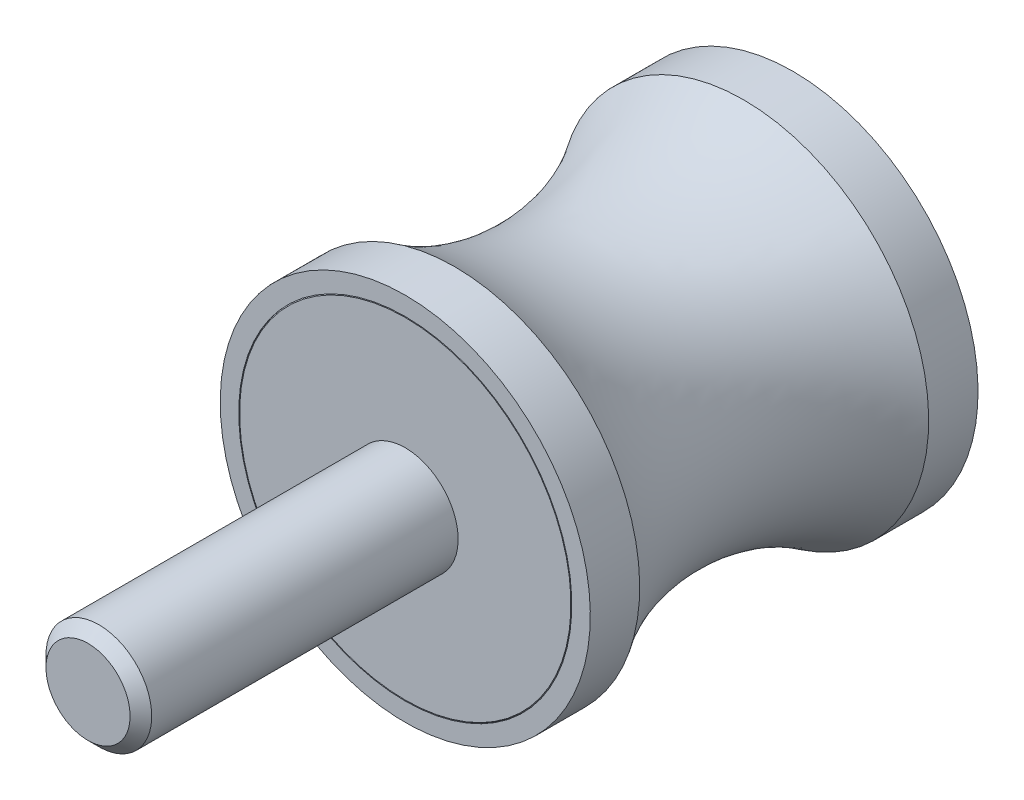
ISO-10303-21;
HEADER;
FILE_DESCRIPTION(('STEP AP214'),'2;1');
FILE_NAME('part.step','',(''),(''),'','','');
FILE_SCHEMA(('AUTOMOTIVE_DESIGN { 1 0 10303 214 1 1 1 1 }'));
ENDSEC;
DATA;
#1=APPLICATION_CONTEXT('core data for automotive mechanical design processes');
#2=APPLICATION_PROTOCOL_DEFINITION('international standard','automotive_design',2000,#1);
#3=PRODUCT_CONTEXT('',#1,'mechanical');
#4=PRODUCT('Part','Part','',(#3));
#5=PRODUCT_RELATED_PRODUCT_CATEGORY('part','',(#4));
#6=PRODUCT_DEFINITION_FORMATION('','',#4);
#7=PRODUCT_DEFINITION_CONTEXT('part definition',#1,'design');
#8=PRODUCT_DEFINITION('design','',#6,#7);
#9=PRODUCT_DEFINITION_SHAPE('','',#8);
#10=(LENGTH_UNIT() NAMED_UNIT(*) SI_UNIT(.MILLI.,.METRE.));
#11=(NAMED_UNIT(*) PLANE_ANGLE_UNIT() SI_UNIT($,.RADIAN.));
#12=(NAMED_UNIT(*) SI_UNIT($,.STERADIAN.) SOLID_ANGLE_UNIT());
#13=UNCERTAINTY_MEASURE_WITH_UNIT(LENGTH_MEASURE(1.E-05),#10,'distance_accuracy_value','');
#14=(GEOMETRIC_REPRESENTATION_CONTEXT(3) GLOBAL_UNCERTAINTY_ASSIGNED_CONTEXT((#13)) GLOBAL_UNIT_ASSIGNED_CONTEXT((#10,
#11,#12)) REPRESENTATION_CONTEXT('',''));
#15=CARTESIAN_POINT('',(0.,0.,0.));
#16=DIRECTION('',(0.,0.,1.));
#17=DIRECTION('',(1.,0.,0.));
#18=AXIS2_PLACEMENT_3D('',#15,#16,#17);
#19=CARTESIAN_POINT('',(0.,0.,0.5));
#20=DIRECTION('',(0.,0.,-1.));
#21=DIRECTION('',(0.,1.,0.));
#22=AXIS2_PLACEMENT_3D('',#19,#20,#21);
#23=CYLINDRICAL_SURFACE('',#22,9.45);
#24=CARTESIAN_POINT('',(0.,0.,0.05));
#25=DIRECTION('',(0.,0.,-1.));
#26=DIRECTION('',(0.,1.,0.));
#27=AXIS2_PLACEMENT_3D('',#24,#25,#26);
#28=CIRCLE('',#27,9.45);
#29=CARTESIAN_POINT('',(0.,9.45,0.05));
#30=VERTEX_POINT('',#29);
#31=EDGE_CURVE('E53',#30,#30,#28,.T.);
#32=ORIENTED_EDGE('',*,*,#31,.F.);
#33=EDGE_LOOP('',(#32));
#34=FACE_BOUND('',#33,.T.);
#35=CARTESIAN_POINT('',(0.,0.,0.));
#36=DIRECTION('',(0.,0.,-1.));
#37=DIRECTION('',(0.,1.,0.));
#38=AXIS2_PLACEMENT_3D('',#35,#36,#37);
#39=CIRCLE('',#38,9.45);
#40=CARTESIAN_POINT('',(0.,9.45,0.));
#41=VERTEX_POINT('',#40);
#42=EDGE_CURVE('E44',#41,#41,#39,.T.);
#43=ORIENTED_EDGE('',*,*,#42,.T.);
#44=EDGE_LOOP('',(#43));
#45=FACE_BOUND('',#44,.T.);
#46=ADVANCED_FACE('F12',(#34,#45),#23,.F.);
#47=CARTESIAN_POINT('',(0.,0.,0.5));
#48=DIRECTION('',(0.,0.,-1.));
#49=DIRECTION('',(0.,1.,0.));
#50=AXIS2_PLACEMENT_3D('',#47,#48,#49);
#51=CYLINDRICAL_SURFACE('',#50,9.45);
#52=CARTESIAN_POINT('',(0.,0.,22.));
#53=DIRECTION('',(0.,0.,-1.));
#54=DIRECTION('',(0.,1.,0.));
#55=AXIS2_PLACEMENT_3D('',#52,#53,#54);
#56=CIRCLE('',#55,9.45);
#57=CARTESIAN_POINT('',(0.,9.45,22.));
#58=VERTEX_POINT('',#57);
#59=EDGE_CURVE('E27',#58,#58,#56,.T.);
#60=ORIENTED_EDGE('',*,*,#59,.F.);
#61=EDGE_LOOP('',(#60));
#62=FACE_BOUND('',#61,.T.);
#63=CARTESIAN_POINT('',(0.,0.,21.95));
#64=DIRECTION('',(0.,0.,-1.));
#65=DIRECTION('',(0.,1.,0.));
#66=AXIS2_PLACEMENT_3D('',#63,#64,#65);
#67=CIRCLE('',#66,9.45);
#68=CARTESIAN_POINT('',(0.,9.45,21.95));
#69=VERTEX_POINT('',#68);
#70=EDGE_CURVE('E50',#69,#69,#67,.T.);
#71=ORIENTED_EDGE('',*,*,#70,.T.);
#72=EDGE_LOOP('',(#71));
#73=FACE_BOUND('',#72,.T.);
#74=ADVANCED_FACE('F89',(#62,#73),#51,.F.);
#75=CARTESIAN_POINT('',(9.45,0.,22.));
#76=DIRECTION('',(0.,0.,-1.));
#77=DIRECTION('',(0.,1.,0.));
#78=AXIS2_PLACEMENT_3D('',#75,#76,#77);
#79=PLANE('',#78);
#80=CARTESIAN_POINT('',(0.,0.,22.));
#81=DIRECTION('',(0.,0.,-1.));
#82=DIRECTION('',(0.,1.,0.));
#83=AXIS2_PLACEMENT_3D('',#80,#81,#82);
#84=CIRCLE('',#83,10.5);
#85=CARTESIAN_POINT('',(0.,10.5,22.));
#86=VERTEX_POINT('',#85);
#87=EDGE_CURVE('E32',#86,#86,#84,.T.);
#88=ORIENTED_EDGE('',*,*,#87,.F.);
#89=EDGE_LOOP('',(#88));
#90=FACE_BOUND('',#89,.T.);
#91=ORIENTED_EDGE('',*,*,#59,.T.);
#92=EDGE_LOOP('',(#91));
#93=FACE_BOUND('',#92,.T.);
#94=ADVANCED_FACE('F115',(#90,#93),#79,.F.);
#95=CARTESIAN_POINT('',(0.,0.,0.5));
#96=DIRECTION('',(0.,0.,-1.));
#97=DIRECTION('',(0.,1.,0.));
#98=AXIS2_PLACEMENT_3D('',#95,#96,#97);
#99=CYLINDRICAL_SURFACE('',#98,10.5);
#100=CARTESIAN_POINT('',(0.,0.,19.1989159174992));
#101=DIRECTION('',(0.,0.,-1.));
#102=DIRECTION('',(0.,1.,0.));
#103=AXIS2_PLACEMENT_3D('',#100,#101,#102);
#104=CIRCLE('',#103,10.5);
#105=CARTESIAN_POINT('',(0.,10.5,19.1989159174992));
#106=VERTEX_POINT('',#105);
#107=EDGE_CURVE('E35',#106,#106,#104,.T.);
#108=ORIENTED_EDGE('',*,*,#107,.F.);
#109=EDGE_LOOP('',(#108));
#110=FACE_BOUND('',#109,.T.);
#111=ORIENTED_EDGE('',*,*,#87,.T.);
#112=EDGE_LOOP('',(#111));
#113=FACE_BOUND('',#112,.T.);
#114=ADVANCED_FACE('F109',(#110,#113),#99,.T.);
#115=CARTESIAN_POINT('',(0.,0.,11.));
#116=DIRECTION('',(0.,0.,-1.));
#117=DIRECTION('',(0.,1.,0.));
#118=AXIS2_PLACEMENT_3D('',#115,#116,#117);
#119=TOROIDAL_SURFACE('',#118,22.6944444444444,14.6944444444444);
#120=CARTESIAN_POINT('',(0.,0.,2.80108408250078));
#121=DIRECTION('',(0.,0.,-1.));
#122=DIRECTION('',(0.,1.,0.));
#123=AXIS2_PLACEMENT_3D('',#120,#121,#122);
#124=CIRCLE('',#123,10.5);
#125=CARTESIAN_POINT('',(0.,10.5,2.80108408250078));
#126=VERTEX_POINT('',#125);
#127=EDGE_CURVE('E38',#126,#126,#124,.T.);
#128=ORIENTED_EDGE('',*,*,#127,.F.);
#129=EDGE_LOOP('',(#128));
#130=FACE_BOUND('',#129,.T.);
#131=ORIENTED_EDGE('',*,*,#107,.T.);
#132=EDGE_LOOP('',(#131));
#133=FACE_BOUND('',#132,.T.);
#134=ADVANCED_FACE('F103',(#130,#133),#119,.F.);
#135=CARTESIAN_POINT('',(0.,0.,0.5));
#136=DIRECTION('',(0.,0.,-1.));
#137=DIRECTION('',(0.,1.,0.));
#138=AXIS2_PLACEMENT_3D('',#135,#136,#137);
#139=CYLINDRICAL_SURFACE('',#138,10.5);
#140=CARTESIAN_POINT('',(0.,0.,0.));
#141=DIRECTION('',(0.,0.,-1.));
#142=DIRECTION('',(0.,1.,0.));
#143=AXIS2_PLACEMENT_3D('',#140,#141,#142);
#144=CIRCLE('',#143,10.5);
#145=CARTESIAN_POINT('',(0.,10.5,0.));
#146=VERTEX_POINT('',#145);
#147=EDGE_CURVE('E41',#146,#146,#144,.T.);
#148=ORIENTED_EDGE('',*,*,#147,.F.);
#149=EDGE_LOOP('',(#148));
#150=FACE_BOUND('',#149,.T.);
#151=ORIENTED_EDGE('',*,*,#127,.T.);
#152=EDGE_LOOP('',(#151));
#153=FACE_BOUND('',#152,.T.);
#154=ADVANCED_FACE('F97',(#150,#153),#139,.T.);
#155=CARTESIAN_POINT('',(10.5,0.,0.));
#156=DIRECTION('',(0.,0.,1.));
#157=DIRECTION('',(0.,-1.,0.));
#158=AXIS2_PLACEMENT_3D('',#155,#156,#157);
#159=PLANE('',#158);
#160=ORIENTED_EDGE('',*,*,#42,.F.);
#161=EDGE_LOOP('',(#160));
#162=FACE_BOUND('',#161,.T.);
#163=ORIENTED_EDGE('',*,*,#147,.T.);
#164=EDGE_LOOP('',(#163));
#165=FACE_BOUND('',#164,.T.);
#166=ADVANCED_FACE('F93',(#162,#165),#159,.F.);
#167=CARTESIAN_POINT('',(0.,0.,22.));
#168=DIRECTION('',(0.,0.,-1.));
#169=DIRECTION('',(0.,1.,0.));
#170=AXIS2_PLACEMENT_3D('',#167,#168,#169);
#171=PLANE('',#170);
#172=CARTESIAN_POINT('',(0.,0.,22.));
#173=DIRECTION('',(0.,0.,-1.));
#174=DIRECTION('',(0.,1.,0.));
#175=AXIS2_PLACEMENT_3D('',#172,#173,#174);
#176=CIRCLE('',#175,9.4);
#177=CARTESIAN_POINT('',(0.,9.4,22.));
#178=VERTEX_POINT('',#177);
#179=EDGE_CURVE('E47',#178,#178,#176,.T.);
#180=ORIENTED_EDGE('',*,*,#179,.F.);
#181=EDGE_LOOP('',(#180));
#182=FACE_BOUND('',#181,.T.);
#183=CARTESIAN_POINT('',(0.,0.,22.));
#184=DIRECTION('',(0.,0.,-1.));
#185=DIRECTION('',(0.,1.,0.));
#186=AXIS2_PLACEMENT_3D('',#183,#184,#185);
#187=CIRCLE('',#186,3.);
#188=CARTESIAN_POINT('',(0.,3.,22.));
#189=VERTEX_POINT('',#188);
#190=EDGE_CURVE('E8',#189,#189,#187,.T.);
#191=ORIENTED_EDGE('',*,*,#190,.T.);
#192=EDGE_LOOP('',(#191));
#193=FACE_BOUND('',#192,.T.);
#194=ADVANCED_FACE('F96',(#182,#193),#171,.F.);
#195=CARTESIAN_POINT('',(0.,0.,22.));
#196=DIRECTION('',(0.,0.,-1.));
#197=DIRECTION('',(0.,1.,0.));
#198=AXIS2_PLACEMENT_3D('',#195,#196,#197);
#199=CONICAL_SURFACE('',#198,9.4,0.7853981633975);
#200=ORIENTED_EDGE('',*,*,#70,.F.);
#201=EDGE_LOOP('',(#200));
#202=FACE_BOUND('',#201,.T.);
#203=ORIENTED_EDGE('',*,*,#179,.T.);
#204=EDGE_LOOP('',(#203));
#205=FACE_BOUND('',#204,.T.);
#206=ADVANCED_FACE('F129',(#202,#205),#199,.T.);
#207=CARTESIAN_POINT('',(0.,0.,40.));
#208=DIRECTION('',(0.,0.,-1.));
#209=DIRECTION('',(0.,1.,0.));
#210=AXIS2_PLACEMENT_3D('',#207,#208,#209);
#211=PLANE('',#210);
#212=CARTESIAN_POINT('',(0.,0.,40.));
#213=DIRECTION('',(0.,0.,-1.));
#214=DIRECTION('',(0.,1.,0.));
#215=AXIS2_PLACEMENT_3D('',#212,#213,#214);
#216=CIRCLE('',#215,2.3865);
#217=CARTESIAN_POINT('',(0.,2.3865,40.));
#218=VERTEX_POINT('',#217);
#219=EDGE_CURVE('E19',#218,#218,#216,.T.);
#220=ORIENTED_EDGE('',*,*,#219,.F.);
#221=EDGE_LOOP('',(#220));
#222=FACE_BOUND('',#221,.T.);
#223=ADVANCED_FACE('F14',(#222),#211,.F.);
#224=CARTESIAN_POINT('',(0.,0.,40.));
#225=DIRECTION('',(0.,0.,-1.));
#226=DIRECTION('',(0.,1.,0.));
#227=AXIS2_PLACEMENT_3D('',#224,#225,#226);
#228=CONICAL_SURFACE('',#227,2.3865,0.785398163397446);
#229=CARTESIAN_POINT('',(0.,0.,39.3865));
#230=DIRECTION('',(0.,0.,-1.));
#231=DIRECTION('',(0.,1.,0.));
#232=AXIS2_PLACEMENT_3D('',#229,#230,#231);
#233=CIRCLE('',#232,3.);
#234=CARTESIAN_POINT('',(0.,3.,39.3865));
#235=VERTEX_POINT('',#234);
#236=EDGE_CURVE('E23',#235,#235,#233,.T.);
#237=ORIENTED_EDGE('',*,*,#236,.F.);
#238=EDGE_LOOP('',(#237));
#239=FACE_BOUND('',#238,.T.);
#240=ORIENTED_EDGE('',*,*,#219,.T.);
#241=EDGE_LOOP('',(#240));
#242=FACE_BOUND('',#241,.T.);
#243=ADVANCED_FACE('F142',(#239,#242),#228,.T.);
#244=CARTESIAN_POINT('',(0.,0.,0.5));
#245=DIRECTION('',(0.,0.,-1.));
#246=DIRECTION('',(0.,1.,0.));
#247=AXIS2_PLACEMENT_3D('',#244,#245,#246);
#248=CYLINDRICAL_SURFACE('',#247,3.);
#249=ORIENTED_EDGE('',*,*,#190,.F.);
#250=EDGE_LOOP('',(#249));
#251=FACE_BOUND('',#250,.T.);
#252=ORIENTED_EDGE('',*,*,#236,.T.);
#253=EDGE_LOOP('',(#252));
#254=FACE_BOUND('',#253,.T.);
#255=ADVANCED_FACE('F83',(#251,#254),#248,.T.);
#256=CARTESIAN_POINT('',(0.,0.,0.05));
#257=DIRECTION('',(0.,0.,1.));
#258=DIRECTION('',(0.,-1.,0.));
#259=AXIS2_PLACEMENT_3D('',#256,#257,#258);
#260=CONICAL_SURFACE('',#259,9.45,0.785398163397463);
#261=CARTESIAN_POINT('',(0.,0.,0.));
#262=DIRECTION('',(0.,0.,-1.));
#263=DIRECTION('',(0.,1.,0.));
#264=AXIS2_PLACEMENT_3D('',#261,#262,#263);
#265=CIRCLE('',#264,9.4);
#266=CARTESIAN_POINT('',(0.,9.4,0.));
#267=VERTEX_POINT('',#266);
#268=EDGE_CURVE('E56',#267,#267,#265,.T.);
#269=ORIENTED_EDGE('',*,*,#268,.F.);
#270=EDGE_LOOP('',(#269));
#271=FACE_BOUND('',#270,.T.);
#272=ORIENTED_EDGE('',*,*,#31,.T.);
#273=EDGE_LOOP('',(#272));
#274=FACE_BOUND('',#273,.T.);
#275=ADVANCED_FACE('F77',(#271,#274),#260,.T.);
#276=CARTESIAN_POINT('',(9.4,0.,0.));
#277=DIRECTION('',(0.,0.,1.));
#278=DIRECTION('',(0.,-1.,0.));
#279=AXIS2_PLACEMENT_3D('',#276,#277,#278);
#280=PLANE('',#279);
#281=CARTESIAN_POINT('',(0.,0.,0.));
#282=DIRECTION('',(0.,0.,-1.));
#283=DIRECTION('',(0.,1.,0.));
#284=AXIS2_PLACEMENT_3D('',#281,#282,#283);
#285=CIRCLE('',#284,3.);
#286=CARTESIAN_POINT('',(0.,3.,0.));
#287=VERTEX_POINT('',#286);
#288=EDGE_CURVE('E60',#287,#287,#285,.T.);
#289=ORIENTED_EDGE('',*,*,#288,.F.);
#290=EDGE_LOOP('',(#289));
#291=FACE_BOUND('',#290,.T.);
#292=ORIENTED_EDGE('',*,*,#268,.T.);
#293=EDGE_LOOP('',(#292));
#294=FACE_BOUND('',#293,.T.);
#295=ADVANCED_FACE('F71',(#291,#294),#280,.F.);
#296=CARTESIAN_POINT('',(0.,0.,6.));
#297=DIRECTION('',(0.,0.,-1.));
#298=DIRECTION('',(0.,1.,0.));
#299=AXIS2_PLACEMENT_3D('',#296,#297,#298);
#300=CYLINDRICAL_SURFACE('',#299,3.);
#301=CARTESIAN_POINT('',(0.,0.,6.));
#302=DIRECTION('',(0.,0.,-1.));
#303=DIRECTION('',(0.,1.,0.));
#304=AXIS2_PLACEMENT_3D('',#301,#302,#303);
#305=CIRCLE('',#304,3.);
#306=CARTESIAN_POINT('',(0.,3.,6.));
#307=VERTEX_POINT('',#306);
#308=EDGE_CURVE('E59',#307,#307,#305,.T.);
#309=ORIENTED_EDGE('',*,*,#308,.F.);
#310=EDGE_LOOP('',(#309));
#311=FACE_BOUND('',#310,.T.);
#312=ORIENTED_EDGE('',*,*,#288,.T.);
#313=EDGE_LOOP('',(#312));
#314=FACE_BOUND('',#313,.T.);
#315=ADVANCED_FACE('F68',(#311,#314),#300,.F.);
#316=CARTESIAN_POINT('',(0.,0.,6.));
#317=DIRECTION('',(0.,0.,-1.));
#318=DIRECTION('',(0.,1.,0.));
#319=AXIS2_PLACEMENT_3D('',#316,#317,#318);
#320=PLANE('',#319);
#321=ORIENTED_EDGE('',*,*,#308,.T.);
#322=EDGE_LOOP('',(#321));
#323=FACE_BOUND('',#322,.T.);
#324=ADVANCED_FACE('F66',(#323),#320,.T.);
#325=CLOSED_SHELL('',(#46,#74,#94,#114,#134,#154,#166,#194,#206,#223,#243,#255,#275,#295,#315,#324));
#326=MANIFOLD_SOLID_BREP('B1',#325);
#327=ADVANCED_BREP_SHAPE_REPRESENTATION('',(#18,#326),#14);
#328=SHAPE_DEFINITION_REPRESENTATION(#9,#327);
ENDSEC;
END-ISO-10303-21;
